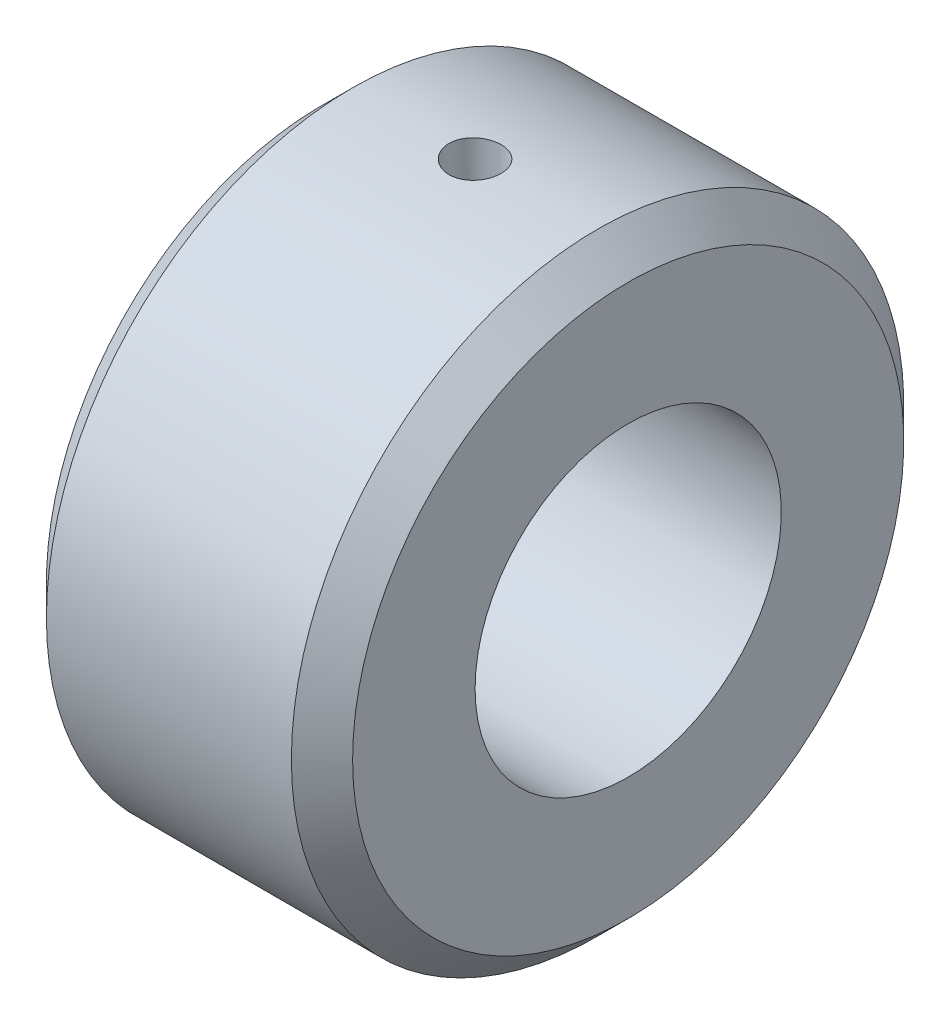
from build123d import *

# Parameters (mm, degrees)
SKIZZE3_W  = 50
SKIZZE3_H  = 25
FASE1_SIZE = 5
SKIZZE9_W  = 4.25
SKIZZE9_H  = 50


with BuildPart() as part:
    # Skizze3 → Rotation1 (revolve)
    with BuildSketch(Plane.XY, mode=Mode.PRIVATE) as rotation1_sk:
        with Locations((0.771582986, 37.5)):
            Rectangle(SKIZZE3_W, SKIZZE3_H)
    revolve(rotation1_sk.sketch.rotate(Axis((-35.497448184, 0, 0), (1, 0, 0)), 90), axis=Axis((-35.497448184, 0, 0), (1, 0, 0)))

    # Fase1
    fase1_edges = [part.edges().sort_by_distance(p)[0] for p in [
        (-24.228417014, 0, -50),
        (25.771582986, 0, -50),
    ]]
    chamfer(fase1_edges, length=FASE1_SIZE)

    # Skizze9 → M10 Gewindebohrung3 (revolve, cut)
    with BuildSketch(Plane(origin=(0.771582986, 0, 0), x_dir=(0, 0, -1), z_dir=(1, 0, 0))):
        with Locations((2.125, 25)):
            Rectangle(SKIZZE9_W, SKIZZE9_H)
    revolve(axis=Axis((0.771582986, -6.35, 0), (0, 1, 0)), mode=Mode.SUBTRACT)


solid = part.part
